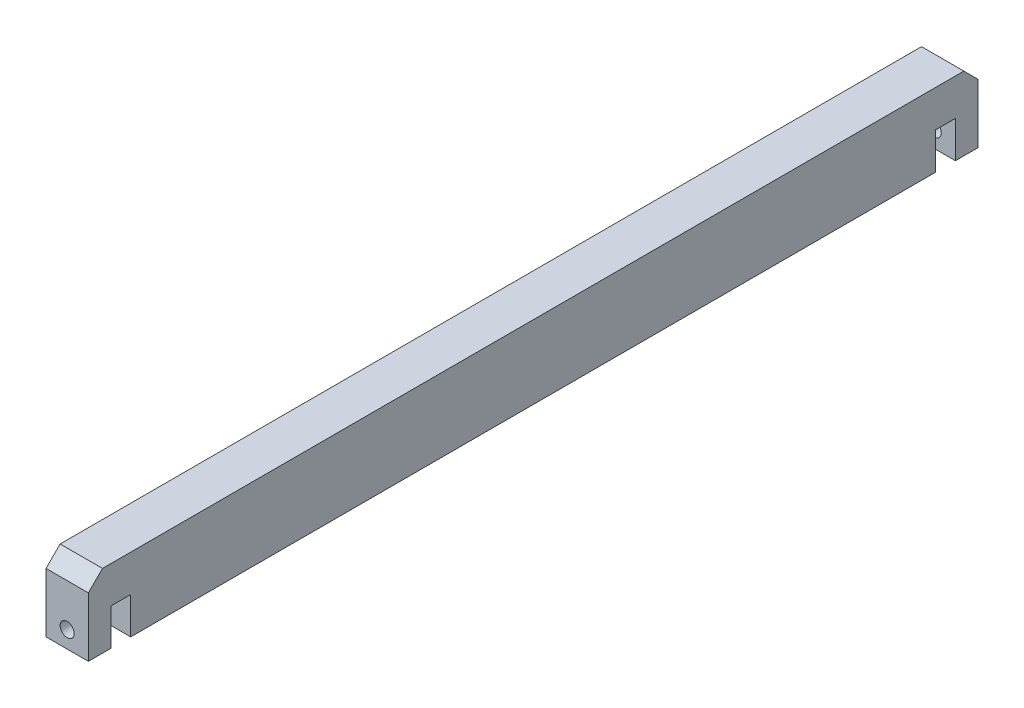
ISO-10303-21;
HEADER;
FILE_DESCRIPTION(('STEP AP214'),'2;1');
FILE_NAME('part.step','',(''),(''),'','','');
FILE_SCHEMA(('AUTOMOTIVE_DESIGN { 1 0 10303 214 1 1 1 1 }'));
ENDSEC;
DATA;
#1=APPLICATION_CONTEXT('core data for automotive mechanical design processes');
#2=APPLICATION_PROTOCOL_DEFINITION('international standard','automotive_design',2000,#1);
#3=PRODUCT_CONTEXT('',#1,'mechanical');
#4=PRODUCT('Part','Part','',(#3));
#5=PRODUCT_RELATED_PRODUCT_CATEGORY('part','',(#4));
#6=PRODUCT_DEFINITION_FORMATION('','',#4);
#7=PRODUCT_DEFINITION_CONTEXT('part definition',#1,'design');
#8=PRODUCT_DEFINITION('design','',#6,#7);
#9=PRODUCT_DEFINITION_SHAPE('','',#8);
#10=(LENGTH_UNIT() NAMED_UNIT(*) SI_UNIT(.MILLI.,.METRE.));
#11=(NAMED_UNIT(*) PLANE_ANGLE_UNIT() SI_UNIT($,.RADIAN.));
#12=(NAMED_UNIT(*) SI_UNIT($,.STERADIAN.) SOLID_ANGLE_UNIT());
#13=UNCERTAINTY_MEASURE_WITH_UNIT(LENGTH_MEASURE(1.E-05),#10,'distance_accuracy_value','');
#14=(GEOMETRIC_REPRESENTATION_CONTEXT(3) GLOBAL_UNCERTAINTY_ASSIGNED_CONTEXT((#13)) GLOBAL_UNIT_ASSIGNED_CONTEXT((#10,
#11,#12)) REPRESENTATION_CONTEXT('',''));
#15=CARTESIAN_POINT('',(0.,0.,0.));
#16=DIRECTION('',(0.,0.,1.));
#17=DIRECTION('',(1.,0.,0.));
#18=AXIS2_PLACEMENT_3D('',#15,#16,#17);
#19=CARTESIAN_POINT('',(0.,0.,157.5));
#20=DIRECTION('',(1.,0.,0.));
#21=DIRECTION('',(0.,0.,-1.));
#22=AXIS2_PLACEMENT_3D('',#19,#20,#21);
#23=PLANE('',#22);
#24=DIRECTION('',(0.,-1.,0.));
#25=VECTOR('',#24,1.);
#26=CARTESIAN_POINT('',(0.,-9.31605176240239,-149.5));
#27=LINE('',#26,#25);
#28=CARTESIAN_POINT('',(0.,13.,-149.5));
#29=VERTEX_POINT('',#28);
#30=CARTESIAN_POINT('',(0.,0.,-149.5));
#31=VERTEX_POINT('',#30);
#32=EDGE_CURVE('E148',#29,#31,#27,.T.);
#33=ORIENTED_EDGE('',*,*,#32,.F.);
#34=DIRECTION('',(0.,0.,-1.));
#35=VECTOR('',#34,1.);
#36=CARTESIAN_POINT('',(0.,13.,-149.5));
#37=LINE('',#36,#35);
#38=CARTESIAN_POINT('',(0.,13.,-142.5));
#39=VERTEX_POINT('',#38);
#40=EDGE_CURVE('E138',#39,#29,#37,.T.);
#41=ORIENTED_EDGE('',*,*,#40,.F.);
#42=DIRECTION('',(0.,1.,0.));
#43=VECTOR('',#42,1.);
#44=CARTESIAN_POINT('',(0.,-9.31605176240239,-142.5));
#45=LINE('',#44,#43);
#46=CARTESIAN_POINT('',(0.,0.,-142.5));
#47=VERTEX_POINT('',#46);
#48=EDGE_CURVE('E147',#47,#39,#45,.T.);
#49=ORIENTED_EDGE('',*,*,#48,.F.);
#50=DIRECTION('',(0.,0.,-1.));
#51=VECTOR('',#50,1.);
#52=CARTESIAN_POINT('',(0.,0.,157.5));
#53=LINE('',#52,#51);
#54=CARTESIAN_POINT('',(0.,0.,142.5));
#55=VERTEX_POINT('',#54);
#56=EDGE_CURVE('E230',#55,#47,#53,.T.);
#57=ORIENTED_EDGE('',*,*,#56,.F.);
#58=DIRECTION('',(0.,1.,0.));
#59=VECTOR('',#58,1.);
#60=CARTESIAN_POINT('',(0.,-9.31605176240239,142.5));
#61=LINE('',#60,#59);
#62=CARTESIAN_POINT('',(0.,13.,142.5));
#63=VERTEX_POINT('',#62);
#64=EDGE_CURVE('E180',#55,#63,#61,.T.);
#65=ORIENTED_EDGE('',*,*,#64,.T.);
#66=DIRECTION('',(0.,0.,1.));
#67=VECTOR('',#66,1.);
#68=CARTESIAN_POINT('',(0.,13.,149.5));
#69=LINE('',#68,#67);
#70=CARTESIAN_POINT('',(0.,13.,149.5));
#71=VERTEX_POINT('',#70);
#72=EDGE_CURVE('E184',#63,#71,#69,.T.);
#73=ORIENTED_EDGE('',*,*,#72,.T.);
#74=DIRECTION('',(0.,-1.,0.));
#75=VECTOR('',#74,1.);
#76=CARTESIAN_POINT('',(0.,-9.31605176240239,149.5));
#77=LINE('',#76,#75);
#78=CARTESIAN_POINT('',(0.,0.,149.5));
#79=VERTEX_POINT('',#78);
#80=EDGE_CURVE('E177',#71,#79,#77,.T.);
#81=ORIENTED_EDGE('',*,*,#80,.T.);
#82=CARTESIAN_POINT('',(0.,0.,157.5));
#83=VERTEX_POINT('',#82);
#84=EDGE_CURVE('E226',#83,#79,#53,.T.);
#85=ORIENTED_EDGE('',*,*,#84,.F.);
#86=DIRECTION('',(0.,-1.,0.));
#87=VECTOR('',#86,1.);
#88=CARTESIAN_POINT('',(0.,0.,157.5));
#89=LINE('',#88,#87);
#90=CARTESIAN_POINT('',(0.,21.,157.5));
#91=VERTEX_POINT('',#90);
#92=EDGE_CURVE('E202',#91,#83,#89,.T.);
#93=ORIENTED_EDGE('',*,*,#92,.F.);
#94=DIRECTION('',(0.,-0.707106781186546,0.707106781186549));
#95=VECTOR('',#94,1.);
#96=CARTESIAN_POINT('',(0.,21.,157.5));
#97=LINE('',#96,#95);
#98=CARTESIAN_POINT('',(0.,26.,152.5));
#99=VERTEX_POINT('',#98);
#100=EDGE_CURVE('E238',#91,#99,#97,.F.);
#101=ORIENTED_EDGE('',*,*,#100,.T.);
#102=DIRECTION('',(0.,0.,-1.));
#103=VECTOR('',#102,1.);
#104=CARTESIAN_POINT('',(0.,26.,157.5));
#105=LINE('',#104,#103);
#106=CARTESIAN_POINT('',(0.,26.,-152.5));
#107=VERTEX_POINT('',#106);
#108=EDGE_CURVE('E209',#99,#107,#105,.T.);
#109=ORIENTED_EDGE('',*,*,#108,.T.);
#110=DIRECTION('',(0.,-0.707106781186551,-0.707106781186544));
#111=VECTOR('',#110,1.);
#112=CARTESIAN_POINT('',(0.,26.,-152.5));
#113=LINE('',#112,#111);
#114=CARTESIAN_POINT('',(0.,20.9999999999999,-157.5));
#115=VERTEX_POINT('',#114);
#116=EDGE_CURVE('E240',#107,#115,#113,.T.);
#117=ORIENTED_EDGE('',*,*,#116,.T.);
#118=DIRECTION('',(0.,-1.,0.));
#119=VECTOR('',#118,1.);
#120=CARTESIAN_POINT('',(0.,0.,-157.5));
#121=LINE('',#120,#119);
#122=CARTESIAN_POINT('',(0.,0.,-157.5));
#123=VERTEX_POINT('',#122);
#124=EDGE_CURVE('E201',#115,#123,#121,.T.);
#125=ORIENTED_EDGE('',*,*,#124,.T.);
#126=EDGE_CURVE('E155',#31,#123,#53,.T.);
#127=ORIENTED_EDGE('',*,*,#126,.F.);
#128=EDGE_LOOP('',(#33,#41,#49,#57,#65,#73,#81,#85,#93,#101,#109,#117,#125,#127));
#129=FACE_BOUND('',#128,.T.);
#130=ADVANCED_FACE('F35',(#129),#23,.F.);
#131=CARTESIAN_POINT('',(0.,0.,157.5));
#132=DIRECTION('',(0.,1.,0.));
#133=DIRECTION('',(0.,0.,1.));
#134=AXIS2_PLACEMENT_3D('',#131,#132,#133);
#135=PLANE('',#134);
#136=DIRECTION('',(1.,0.,0.));
#137=VECTOR('',#136,1.);
#138=CARTESIAN_POINT('',(0.,0.,-149.5));
#139=LINE('',#138,#137);
#140=CARTESIAN_POINT('',(15.,0.,-149.5));
#141=VERTEX_POINT('',#140);
#142=EDGE_CURVE('E168',#31,#141,#139,.T.);
#143=ORIENTED_EDGE('',*,*,#142,.F.);
#144=ORIENTED_EDGE('',*,*,#126,.T.);
#145=DIRECTION('',(1.,0.,0.));
#146=VECTOR('',#145,1.);
#147=CARTESIAN_POINT('',(0.,0.,-157.5));
#148=LINE('',#147,#146);
#149=CARTESIAN_POINT('',(15.,0.,-157.5));
#150=VERTEX_POINT('',#149);
#151=EDGE_CURVE('E211',#123,#150,#148,.T.);
#152=ORIENTED_EDGE('',*,*,#151,.T.);
#153=DIRECTION('',(0.,0.,-1.));
#154=VECTOR('',#153,1.);
#155=CARTESIAN_POINT('',(15.,0.,157.5));
#156=LINE('',#155,#154);
#157=EDGE_CURVE('E221',#141,#150,#156,.T.);
#158=ORIENTED_EDGE('',*,*,#157,.F.);
#159=EDGE_LOOP('',(#143,#144,#152,#158));
#160=FACE_BOUND('',#159,.T.);
#161=ADVANCED_FACE('F271',(#160),#135,.F.);
#162=DIRECTION('',(-1.,0.,0.));
#163=VECTOR('',#162,1.);
#164=CARTESIAN_POINT('',(0.,0.,-142.5));
#165=LINE('',#164,#163);
#166=CARTESIAN_POINT('',(15.,0.,-142.5));
#167=VERTEX_POINT('',#166);
#168=EDGE_CURVE('E165',#167,#47,#165,.T.);
#169=ORIENTED_EDGE('',*,*,#168,.F.);
#170=CARTESIAN_POINT('',(15.,0.,142.5));
#171=VERTEX_POINT('',#170);
#172=EDGE_CURVE('E225',#171,#167,#156,.T.);
#173=ORIENTED_EDGE('',*,*,#172,.F.);
#174=DIRECTION('',(-1.,0.,0.));
#175=VECTOR('',#174,1.);
#176=CARTESIAN_POINT('',(0.,0.,142.5));
#177=LINE('',#176,#175);
#178=EDGE_CURVE('E193',#171,#55,#177,.T.);
#179=ORIENTED_EDGE('',*,*,#178,.T.);
#180=ORIENTED_EDGE('',*,*,#56,.T.);
#181=EDGE_LOOP('',(#169,#173,#179,#180));
#182=FACE_BOUND('',#181,.T.);
#183=ADVANCED_FACE('F263',(#182),#135,.F.);
#184=CARTESIAN_POINT('',(15.,0.,157.5));
#185=DIRECTION('',(-1.,0.,0.));
#186=DIRECTION('',(0.,0.,1.));
#187=AXIS2_PLACEMENT_3D('',#184,#185,#186);
#188=PLANE('',#187);
#189=DIRECTION('',(0.,-1.,0.));
#190=VECTOR('',#189,1.);
#191=CARTESIAN_POINT('',(15.,-9.31605176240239,-149.5));
#192=LINE('',#191,#190);
#193=CARTESIAN_POINT('',(15.,13.,-149.5));
#194=VERTEX_POINT('',#193);
#195=EDGE_CURVE('E50',#194,#141,#192,.T.);
#196=ORIENTED_EDGE('',*,*,#195,.T.);
#197=ORIENTED_EDGE('',*,*,#157,.T.);
#198=DIRECTION('',(0.,1.,0.));
#199=VECTOR('',#198,1.);
#200=CARTESIAN_POINT('',(15.,0.,-157.5));
#201=LINE('',#200,#199);
#202=CARTESIAN_POINT('',(15.,20.9999999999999,-157.5));
#203=VERTEX_POINT('',#202);
#204=EDGE_CURVE('E205',#150,#203,#201,.T.);
#205=ORIENTED_EDGE('',*,*,#204,.T.);
#206=DIRECTION('',(0.,0.707106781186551,0.707106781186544));
#207=VECTOR('',#206,1.);
#208=CARTESIAN_POINT('',(15.,26.,-152.5));
#209=LINE('',#208,#207);
#210=CARTESIAN_POINT('',(15.,26.,-152.5));
#211=VERTEX_POINT('',#210);
#212=EDGE_CURVE('E245',#203,#211,#209,.T.);
#213=ORIENTED_EDGE('',*,*,#212,.T.);
#214=DIRECTION('',(0.,0.,-1.));
#215=VECTOR('',#214,1.);
#216=CARTESIAN_POINT('',(15.,26.,157.5));
#217=LINE('',#216,#215);
#218=CARTESIAN_POINT('',(15.,26.,152.5));
#219=VERTEX_POINT('',#218);
#220=EDGE_CURVE('E218',#219,#211,#217,.T.);
#221=ORIENTED_EDGE('',*,*,#220,.F.);
#222=DIRECTION('',(0.,0.707106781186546,-0.707106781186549));
#223=VECTOR('',#222,1.);
#224=CARTESIAN_POINT('',(15.,21.,157.5));
#225=LINE('',#224,#223);
#226=CARTESIAN_POINT('',(15.,21.,157.5));
#227=VERTEX_POINT('',#226);
#228=EDGE_CURVE('E58',#219,#227,#225,.F.);
#229=ORIENTED_EDGE('',*,*,#228,.T.);
#230=DIRECTION('',(0.,1.,0.));
#231=VECTOR('',#230,1.);
#232=CARTESIAN_POINT('',(15.,0.,157.5));
#233=LINE('',#232,#231);
#234=CARTESIAN_POINT('',(15.,0.,157.5));
#235=VERTEX_POINT('',#234);
#236=EDGE_CURVE('E207',#235,#227,#233,.T.);
#237=ORIENTED_EDGE('',*,*,#236,.F.);
#238=CARTESIAN_POINT('',(15.,0.,149.5));
#239=VERTEX_POINT('',#238);
#240=EDGE_CURVE('E222',#235,#239,#156,.T.);
#241=ORIENTED_EDGE('',*,*,#240,.T.);
#242=DIRECTION('',(0.,-1.,0.));
#243=VECTOR('',#242,1.);
#244=CARTESIAN_POINT('',(15.,-9.31605176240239,149.5));
#245=LINE('',#244,#243);
#246=CARTESIAN_POINT('',(15.,13.,149.5));
#247=VERTEX_POINT('',#246);
#248=EDGE_CURVE('E176',#247,#239,#245,.T.);
#249=ORIENTED_EDGE('',*,*,#248,.F.);
#250=DIRECTION('',(0.,0.,1.));
#251=VECTOR('',#250,1.);
#252=CARTESIAN_POINT('',(15.,13.,149.5));
#253=LINE('',#252,#251);
#254=CARTESIAN_POINT('',(15.,13.,142.5));
#255=VERTEX_POINT('',#254);
#256=EDGE_CURVE('E181',#255,#247,#253,.T.);
#257=ORIENTED_EDGE('',*,*,#256,.F.);
#258=DIRECTION('',(0.,-1.,0.));
#259=VECTOR('',#258,1.);
#260=CARTESIAN_POINT('',(15.,0.,142.5));
#261=LINE('',#260,#259);
#262=EDGE_CURVE('E229',#255,#171,#261,.T.);
#263=ORIENTED_EDGE('',*,*,#262,.T.);
#264=ORIENTED_EDGE('',*,*,#172,.T.);
#265=DIRECTION('',(0.,-1.,0.));
#266=VECTOR('',#265,1.);
#267=CARTESIAN_POINT('',(15.,0.,-142.5));
#268=LINE('',#267,#266);
#269=CARTESIAN_POINT('',(15.,13.,-142.5));
#270=VERTEX_POINT('',#269);
#271=EDGE_CURVE('E11',#270,#167,#268,.T.);
#272=ORIENTED_EDGE('',*,*,#271,.F.);
#273=DIRECTION('',(0.,0.,-1.));
#274=VECTOR('',#273,1.);
#275=CARTESIAN_POINT('',(15.,13.,-149.5));
#276=LINE('',#275,#274);
#277=EDGE_CURVE('E156',#270,#194,#276,.T.);
#278=ORIENTED_EDGE('',*,*,#277,.T.);
#279=EDGE_LOOP('',(#196,#197,#205,#213,#221,#229,#237,#241,#249,#257,#263,#264,#272,#278));
#280=FACE_BOUND('',#279,.T.);
#281=ADVANCED_FACE('F260',(#280),#188,.F.);
#282=ORIENTED_EDGE('',*,*,#84,.T.);
#283=DIRECTION('',(1.,0.,0.));
#284=VECTOR('',#283,1.);
#285=CARTESIAN_POINT('',(0.,0.,149.5));
#286=LINE('',#285,#284);
#287=EDGE_CURVE('E198',#79,#239,#286,.T.);
#288=ORIENTED_EDGE('',*,*,#287,.T.);
#289=ORIENTED_EDGE('',*,*,#240,.F.);
#290=DIRECTION('',(1.,0.,0.));
#291=VECTOR('',#290,1.);
#292=CARTESIAN_POINT('',(0.,0.,157.5));
#293=LINE('',#292,#291);
#294=EDGE_CURVE('E204',#83,#235,#293,.T.);
#295=ORIENTED_EDGE('',*,*,#294,.F.);
#296=EDGE_LOOP('',(#282,#288,#289,#295));
#297=FACE_BOUND('',#296,.T.);
#298=ADVANCED_FACE('F257',(#297),#135,.F.);
#299=CARTESIAN_POINT('',(0.,26.,157.5));
#300=DIRECTION('',(0.,-1.,0.));
#301=DIRECTION('',(0.,0.,-1.));
#302=AXIS2_PLACEMENT_3D('',#299,#300,#301);
#303=PLANE('',#302);
#304=ORIENTED_EDGE('',*,*,#220,.T.);
#305=DIRECTION('',(-1.,0.,0.));
#306=VECTOR('',#305,1.);
#307=CARTESIAN_POINT('',(0.,26.,-152.5));
#308=LINE('',#307,#306);
#309=EDGE_CURVE('E235',#211,#107,#308,.T.);
#310=ORIENTED_EDGE('',*,*,#309,.T.);
#311=ORIENTED_EDGE('',*,*,#108,.F.);
#312=DIRECTION('',(1.,0.,0.));
#313=VECTOR('',#312,1.);
#314=CARTESIAN_POINT('',(0.,26.,152.5));
#315=LINE('',#314,#313);
#316=EDGE_CURVE('E233',#99,#219,#315,.T.);
#317=ORIENTED_EDGE('',*,*,#316,.T.);
#318=EDGE_LOOP('',(#304,#310,#311,#317));
#319=FACE_BOUND('',#318,.T.);
#320=ADVANCED_FACE('F269',(#319),#303,.F.);
#321=CARTESIAN_POINT('',(0.,26.,157.5));
#322=DIRECTION('',(0.,0.,-1.));
#323=DIRECTION('',(-1.,0.,0.));
#324=AXIS2_PLACEMENT_3D('',#321,#322,#323);
#325=PLANE('',#324);
#326=CARTESIAN_POINT('',(7.5,6.,157.5));
#327=DIRECTION('',(0.,0.,1.));
#328=DIRECTION('',(1.,0.,0.));
#329=AXIS2_PLACEMENT_3D('',#326,#327,#328);
#330=CIRCLE('',#329,2.49999999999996);
#331=CARTESIAN_POINT('',(9.99999999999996,6.,157.5));
#332=VERTEX_POINT('',#331);
#333=EDGE_CURVE('E170',#332,#332,#330,.T.);
#334=ORIENTED_EDGE('',*,*,#333,.F.);
#335=EDGE_LOOP('',(#334));
#336=FACE_BOUND('',#335,.T.);
#337=ORIENTED_EDGE('',*,*,#236,.T.);
#338=DIRECTION('',(-1.,0.,0.));
#339=VECTOR('',#338,1.);
#340=CARTESIAN_POINT('',(0.,21.,157.5));
#341=LINE('',#340,#339);
#342=EDGE_CURVE('E43',#227,#91,#341,.T.);
#343=ORIENTED_EDGE('',*,*,#342,.T.);
#344=ORIENTED_EDGE('',*,*,#92,.T.);
#345=ORIENTED_EDGE('',*,*,#294,.T.);
#346=EDGE_LOOP('',(#337,#343,#344,#345));
#347=FACE_BOUND('',#346,.T.);
#348=ADVANCED_FACE('F250',(#336,#347),#325,.F.);
#349=CARTESIAN_POINT('',(0.,26.,-157.5));
#350=DIRECTION('',(0.,0.,-1.));
#351=DIRECTION('',(-1.,0.,0.));
#352=AXIS2_PLACEMENT_3D('',#349,#350,#351);
#353=PLANE('',#352);
#354=CARTESIAN_POINT('',(7.5,6.,-157.5));
#355=DIRECTION('',(0.,0.,-1.));
#356=DIRECTION('',(-1.,0.,0.));
#357=AXIS2_PLACEMENT_3D('',#354,#355,#356);
#358=CIRCLE('',#357,2.49999999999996);
#359=CARTESIAN_POINT('',(5.00000000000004,6.,-157.5));
#360=VERTEX_POINT('',#359);
#361=EDGE_CURVE('E442',#360,#360,#358,.T.);
#362=ORIENTED_EDGE('',*,*,#361,.F.);
#363=EDGE_LOOP('',(#362));
#364=FACE_BOUND('',#363,.T.);
#365=ORIENTED_EDGE('',*,*,#124,.F.);
#366=DIRECTION('',(1.,0.,0.));
#367=VECTOR('',#366,1.);
#368=CARTESIAN_POINT('',(15.,20.9999999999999,-157.5));
#369=LINE('',#368,#367);
#370=EDGE_CURVE('E242',#115,#203,#369,.T.);
#371=ORIENTED_EDGE('',*,*,#370,.T.);
#372=ORIENTED_EDGE('',*,*,#204,.F.);
#373=ORIENTED_EDGE('',*,*,#151,.F.);
#374=EDGE_LOOP('',(#365,#371,#372,#373));
#375=FACE_BOUND('',#374,.T.);
#376=ADVANCED_FACE('F300',(#364,#375),#353,.T.);
#377=CARTESIAN_POINT('',(0.,-9.31605176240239,149.5));
#378=DIRECTION('',(0.,0.,1.));
#379=DIRECTION('',(1.,0.,0.));
#380=AXIS2_PLACEMENT_3D('',#377,#378,#379);
#381=PLANE('',#380);
#382=CARTESIAN_POINT('',(7.5,6.,149.5));
#383=DIRECTION('',(0.,0.,1.));
#384=DIRECTION('',(1.,0.,0.));
#385=AXIS2_PLACEMENT_3D('',#382,#383,#384);
#386=CIRCLE('',#385,2.49999999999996);
#387=CARTESIAN_POINT('',(9.99999999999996,6.,149.5));
#388=VERTEX_POINT('',#387);
#389=EDGE_CURVE('E173',#388,#388,#386,.T.);
#390=ORIENTED_EDGE('',*,*,#389,.T.);
#391=EDGE_LOOP('',(#390));
#392=FACE_BOUND('',#391,.T.);
#393=ORIENTED_EDGE('',*,*,#80,.F.);
#394=DIRECTION('',(1.,0.,0.));
#395=VECTOR('',#394,1.);
#396=CARTESIAN_POINT('',(0.,13.,149.5));
#397=LINE('',#396,#395);
#398=EDGE_CURVE('E191',#71,#247,#397,.T.);
#399=ORIENTED_EDGE('',*,*,#398,.T.);
#400=ORIENTED_EDGE('',*,*,#248,.T.);
#401=ORIENTED_EDGE('',*,*,#287,.F.);
#402=EDGE_LOOP('',(#393,#399,#400,#401));
#403=FACE_BOUND('',#402,.T.);
#404=ADVANCED_FACE('F315',(#392,#403),#381,.F.);
#405=CARTESIAN_POINT('',(0.,-9.31605176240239,142.5));
#406=DIRECTION('',(0.,0.,-1.));
#407=DIRECTION('',(-1.,0.,0.));
#408=AXIS2_PLACEMENT_3D('',#405,#406,#407);
#409=PLANE('',#408);
#410=ORIENTED_EDGE('',*,*,#262,.F.);
#411=DIRECTION('',(1.,0.,0.));
#412=VECTOR('',#411,1.);
#413=CARTESIAN_POINT('',(0.,13.,142.5));
#414=LINE('',#413,#412);
#415=EDGE_CURVE('E187',#63,#255,#414,.T.);
#416=ORIENTED_EDGE('',*,*,#415,.F.);
#417=ORIENTED_EDGE('',*,*,#64,.F.);
#418=ORIENTED_EDGE('',*,*,#178,.F.);
#419=EDGE_LOOP('',(#410,#416,#417,#418));
#420=FACE_BOUND('',#419,.T.);
#421=ADVANCED_FACE('F311',(#420),#409,.F.);
#422=CARTESIAN_POINT('',(0.,13.,149.5));
#423=DIRECTION('',(0.,1.,0.));
#424=DIRECTION('',(0.,0.,1.));
#425=AXIS2_PLACEMENT_3D('',#422,#423,#424);
#426=PLANE('',#425);
#427=ORIENTED_EDGE('',*,*,#256,.T.);
#428=ORIENTED_EDGE('',*,*,#398,.F.);
#429=ORIENTED_EDGE('',*,*,#72,.F.);
#430=ORIENTED_EDGE('',*,*,#415,.T.);
#431=EDGE_LOOP('',(#427,#428,#429,#430));
#432=FACE_BOUND('',#431,.T.);
#433=ADVANCED_FACE('F288',(#432),#426,.F.);
#434=CARTESIAN_POINT('',(7.5,6.,157.5));
#435=DIRECTION('',(0.,0.,1.));
#436=DIRECTION('',(1.,0.,0.));
#437=AXIS2_PLACEMENT_3D('',#434,#435,#436);
#438=CYLINDRICAL_SURFACE('',#437,2.49999999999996);
#439=ORIENTED_EDGE('',*,*,#389,.F.);
#440=EDGE_LOOP('',(#439));
#441=FACE_BOUND('',#440,.T.);
#442=ORIENTED_EDGE('',*,*,#333,.T.);
#443=EDGE_LOOP('',(#442));
#444=FACE_BOUND('',#443,.T.);
#445=ADVANCED_FACE('F282',(#441,#444),#438,.F.);
#446=CARTESIAN_POINT('',(0.,26.,-152.5));
#447=DIRECTION('',(0.,0.707106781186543,-0.707106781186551));
#448=DIRECTION('',(0.,0.707106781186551,0.707106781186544));
#449=AXIS2_PLACEMENT_3D('',#446,#447,#448);
#450=PLANE('',#449);
#451=ORIENTED_EDGE('',*,*,#212,.F.);
#452=ORIENTED_EDGE('',*,*,#370,.F.);
#453=ORIENTED_EDGE('',*,*,#116,.F.);
#454=ORIENTED_EDGE('',*,*,#309,.F.);
#455=EDGE_LOOP('',(#451,#452,#453,#454));
#456=FACE_BOUND('',#455,.T.);
#457=ADVANCED_FACE('F280',(#456),#450,.T.);
#458=CARTESIAN_POINT('',(0.,21.,157.5));
#459=DIRECTION('',(0.,-0.707106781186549,-0.707106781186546));
#460=DIRECTION('',(0.,0.707106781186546,-0.707106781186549));
#461=AXIS2_PLACEMENT_3D('',#458,#459,#460);
#462=PLANE('',#461);
#463=ORIENTED_EDGE('',*,*,#228,.F.);
#464=ORIENTED_EDGE('',*,*,#316,.F.);
#465=ORIENTED_EDGE('',*,*,#100,.F.);
#466=ORIENTED_EDGE('',*,*,#342,.F.);
#467=EDGE_LOOP('',(#463,#464,#465,#466));
#468=FACE_BOUND('',#467,.T.);
#469=ADVANCED_FACE('F37',(#468),#462,.F.);
#470=CARTESIAN_POINT('',(0.,-9.31605176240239,-149.5));
#471=DIRECTION('',(0.,0.,1.));
#472=DIRECTION('',(1.,0.,0.));
#473=AXIS2_PLACEMENT_3D('',#470,#471,#472);
#474=PLANE('',#473);
#475=CARTESIAN_POINT('',(7.5,6.,-149.5));
#476=DIRECTION('',(0.,0.,1.));
#477=DIRECTION('',(1.,0.,0.));
#478=AXIS2_PLACEMENT_3D('',#475,#476,#477);
#479=CIRCLE('',#478,2.49999999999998);
#480=CARTESIAN_POINT('',(9.99999999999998,6.,-149.5));
#481=VERTEX_POINT('',#480);
#482=EDGE_CURVE('E160',#481,#481,#479,.T.);
#483=ORIENTED_EDGE('',*,*,#482,.F.);
#484=EDGE_LOOP('',(#483));
#485=FACE_BOUND('',#484,.T.);
#486=ORIENTED_EDGE('',*,*,#142,.T.);
#487=ORIENTED_EDGE('',*,*,#195,.F.);
#488=DIRECTION('',(1.,0.,0.));
#489=VECTOR('',#488,1.);
#490=CARTESIAN_POINT('',(0.,13.,-149.5));
#491=LINE('',#490,#489);
#492=EDGE_CURVE('E141',#29,#194,#491,.T.);
#493=ORIENTED_EDGE('',*,*,#492,.F.);
#494=ORIENTED_EDGE('',*,*,#32,.T.);
#495=EDGE_LOOP('',(#486,#487,#493,#494));
#496=FACE_BOUND('',#495,.T.);
#497=ADVANCED_FACE('F150',(#485,#496),#474,.T.);
#498=CARTESIAN_POINT('',(0.,-9.31605176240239,-142.5));
#499=DIRECTION('',(0.,0.,-1.));
#500=DIRECTION('',(-1.,0.,0.));
#501=AXIS2_PLACEMENT_3D('',#498,#499,#500);
#502=PLANE('',#501);
#503=ORIENTED_EDGE('',*,*,#168,.T.);
#504=ORIENTED_EDGE('',*,*,#48,.T.);
#505=DIRECTION('',(1.,0.,0.));
#506=VECTOR('',#505,1.);
#507=CARTESIAN_POINT('',(0.,13.,-142.5));
#508=LINE('',#507,#506);
#509=EDGE_CURVE('E143',#39,#270,#508,.T.);
#510=ORIENTED_EDGE('',*,*,#509,.T.);
#511=ORIENTED_EDGE('',*,*,#271,.T.);
#512=EDGE_LOOP('',(#503,#504,#510,#511));
#513=FACE_BOUND('',#512,.T.);
#514=ADVANCED_FACE('F307',(#513),#502,.T.);
#515=CARTESIAN_POINT('',(0.,13.,-149.5));
#516=DIRECTION('',(0.,-1.,0.));
#517=DIRECTION('',(0.,0.,-1.));
#518=AXIS2_PLACEMENT_3D('',#515,#516,#517);
#519=PLANE('',#518);
#520=ORIENTED_EDGE('',*,*,#277,.F.);
#521=ORIENTED_EDGE('',*,*,#509,.F.);
#522=ORIENTED_EDGE('',*,*,#40,.T.);
#523=ORIENTED_EDGE('',*,*,#492,.T.);
#524=EDGE_LOOP('',(#520,#521,#522,#523));
#525=FACE_BOUND('',#524,.T.);
#526=ADVANCED_FACE('F140',(#525),#519,.T.);
#527=CARTESIAN_POINT('',(7.5,6.,-157.5));
#528=DIRECTION('',(0.,0.,-1.));
#529=DIRECTION('',(-1.,0.,0.));
#530=AXIS2_PLACEMENT_3D('',#527,#528,#529);
#531=CYLINDRICAL_SURFACE('',#530,2.49999999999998);
#532=ORIENTED_EDGE('',*,*,#361,.T.);
#533=EDGE_LOOP('',(#532));
#534=FACE_BOUND('',#533,.T.);
#535=ORIENTED_EDGE('',*,*,#482,.T.);
#536=EDGE_LOOP('',(#535));
#537=FACE_BOUND('',#536,.T.);
#538=ADVANCED_FACE('F375',(#534,#537),#531,.F.);
#539=CLOSED_SHELL('',(#130,#161,#183,#281,#298,#320,#348,#376,#404,#421,#433,#445,#457,#469,
#497,#514,#526,#538));
#540=MANIFOLD_SOLID_BREP('B2',#539);
#541=ADVANCED_BREP_SHAPE_REPRESENTATION('',(#18,#540),#14);
#542=SHAPE_DEFINITION_REPRESENTATION(#9,#541);
ENDSEC;
END-ISO-10303-21;
